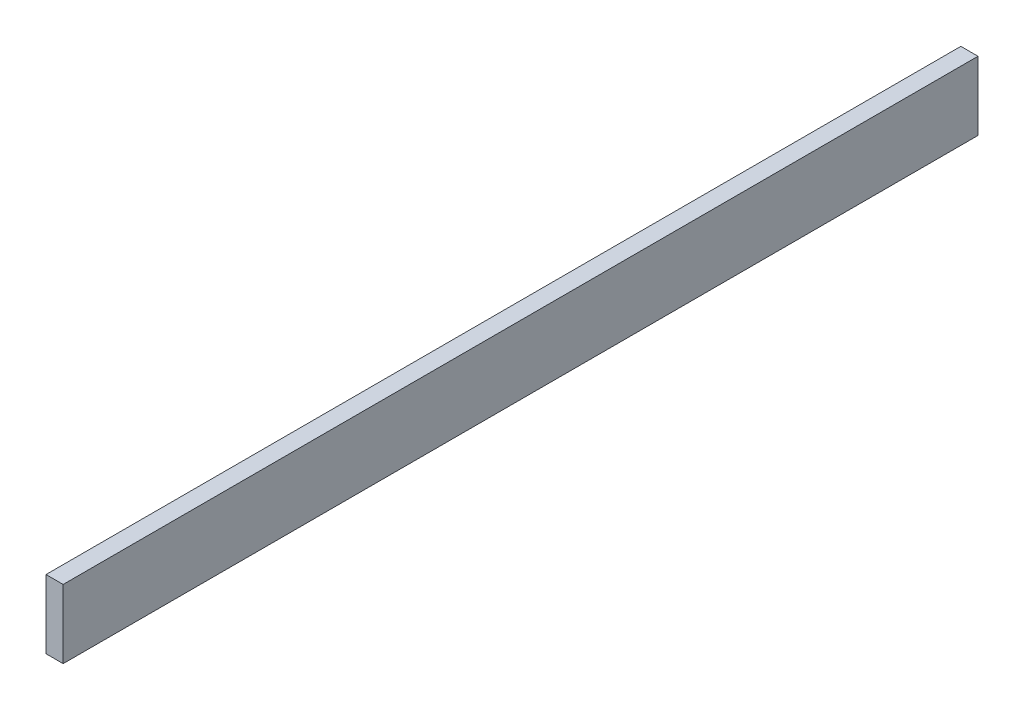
from build123d import *

# Parameters (mm, degrees)
SKETCH1_W           = 80
SKETCH1_H           = 6
BOSS_EXTRUDE1_DEPTH = 1.5


with BuildPart() as part:
    # Sketch1 → Boss-Extrude1 (new body)
    with BuildSketch(Plane(origin=(0, 0, 0), x_dir=(0, 0, -1), z_dir=(1, 0, 0))):
        Rectangle(SKETCH1_W, SKETCH1_H)
    extrude(amount=BOSS_EXTRUDE1_DEPTH)


solid = part.part
